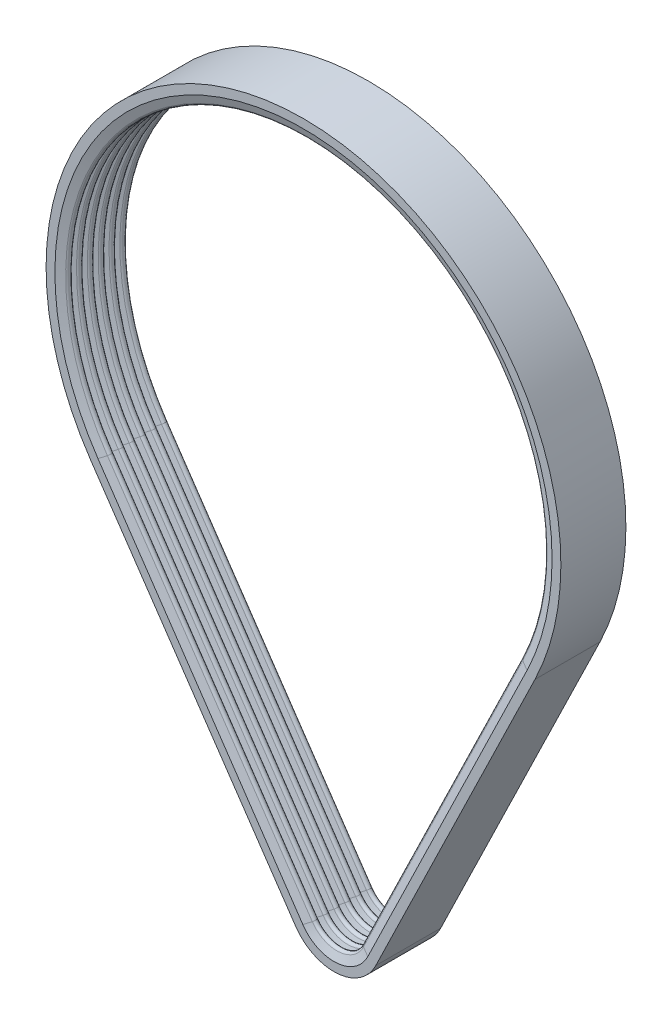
from build123d import *

# Parameters (mm, degrees)
CONG_1_R = 0.4
CONG_2_R = 0.1


with BuildPart() as part:
    # Balayage1: sweep along a path in Ligne primitive
    with BuildLine(Plane.XY) as balayage1_path:
        Line((110.262133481, -488.917302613), (86.747099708, -537.273777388))
        ThreePointArc((86.747099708, -537.273777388), (81.496170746, -540.830140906), (75.786744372, -538.069266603))
        Line((75.786744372, -538.069266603), (45.535625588, -493.615073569))
        ThreePointArc((45.535625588, -493.615073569), (73.82358267, -435.116210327), (110.262133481, -488.917302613))
    # Profil → Balayage1 (sweep)
    with BuildSketch(Plane(origin=(42.022020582, 3.049906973, 0), x_dir=(0, 0, -1), z_dir=(0.9973765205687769, 0.07238837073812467, 0))):
        Polygon((0, -440.11866077), (0.8, -442.316642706), (1.6, -440.11866077), (2.4, -442.316642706), (3.2, -440.11866077), (4, -442.316642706), (4.8, -440.11866077), (4.8, -438.81866077), (-4.8, -438.81866077), (-4.8, -440.11866077), (-4, -442.316642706), (-3.2, -440.11866077), (-2.4, -442.316642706), (-1.6, -440.11866077), (-0.8, -442.316642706), align=None)
    sweep(path=balayage1_path.line)

    # Cong_1
    cong_1_edges = [part.edges().sort_by_distance(p)[0] for p in [
        (63.139718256, -514.155525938, -0.8),
        (63.139718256, -514.155525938, -2.4),
        (63.139718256, -514.155525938, -4),
        (63.139718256, -514.155525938, 4),
        (63.139718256, -514.155525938, 2.4),
        (63.139718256, -514.155525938, 0.8),
        (74.040601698, -438.106327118, -0.8),
        (74.040601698, -438.106327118, -2.4),
        (74.040601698, -438.106327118, -4),
        (74.040601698, -438.106327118, 4),
        (74.040601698, -438.106327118, 2.4),
        (74.040601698, -438.106327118, 0.8),
        (95.8085125, -511.784464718, -0.8),
        (95.8085125, -511.784464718, -2.4),
        (95.8085125, -511.784464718, -4),
        (95.8085125, -511.784464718, 4),
        (95.8085125, -511.784464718, 2.4),
        (95.8085125, -511.784464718, 0.8),
        (81.279151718, -537.840024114, -0.8),
        (81.279151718, -537.840024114, -2.4),
        (81.279151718, -537.840024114, -4),
        (81.279151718, -537.840024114, 4),
        (81.279151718, -537.840024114, 2.4),
        (81.279151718, -537.840024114, 0.8),
    ]]
    fillet(cong_1_edges, radius=CONG_1_R)

    # Cong_2
    cong_2_edges = [part.edges().sort_by_distance(p)[0] for p in [
        (61.322572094, -515.392095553, 0),
        (81.438260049, -540.032239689, 0),
        (73.881493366, -435.914111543, 0),
        (97.78517154, -512.745684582, 0),
        (61.322572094, -515.392095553, -1.6),
        (81.438260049, -540.032239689, -1.6),
        (73.881493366, -435.914111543, -1.6),
        (61.322572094, -515.392095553, 1.6),
        (97.78517154, -512.745684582, -1.6),
        (81.438260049, -540.032239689, 1.6),
        (73.881493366, -435.914111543, 1.6),
        (97.78517154, -512.745684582, 1.6),
        (61.322572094, -515.392095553, -3.2),
        (81.438260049, -540.032239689, -3.2),
        (73.881493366, -435.914111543, -3.2),
        (61.322572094, -515.392095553, 3.2),
        (97.78517154, -512.745684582, -3.2),
        (81.438260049, -540.032239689, 3.2),
        (73.881493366, -435.914111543, 3.2),
        (97.78517154, -512.745684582, 3.2),
    ]]
    fillet(cong_2_edges, radius=CONG_2_R)


solid = part.part
